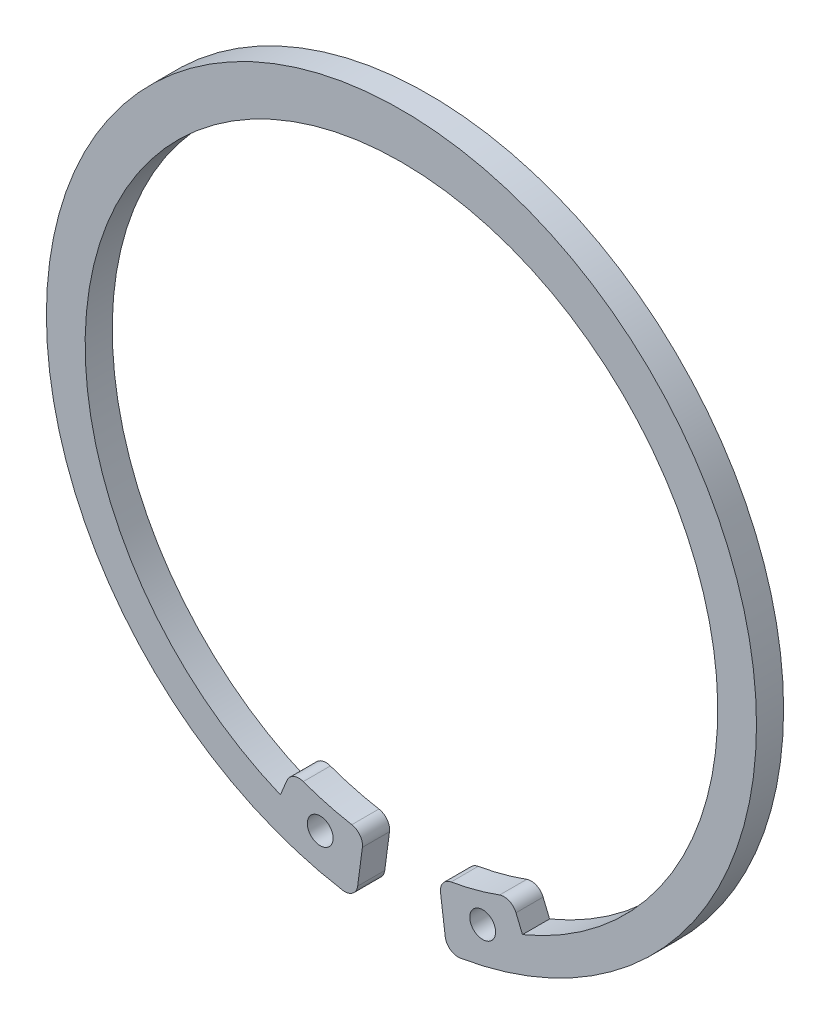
ISO-10303-21;
HEADER;
FILE_DESCRIPTION(('STEP AP214'),'2;1');
FILE_NAME('part.step','',(''),(''),'','','');
FILE_SCHEMA(('AUTOMOTIVE_DESIGN { 1 0 10303 214 1 1 1 1 }'));
ENDSEC;
DATA;
#1=APPLICATION_CONTEXT('core data for automotive mechanical design processes');
#2=APPLICATION_PROTOCOL_DEFINITION('international standard','automotive_design',2000,#1);
#3=PRODUCT_CONTEXT('',#1,'mechanical');
#4=PRODUCT('Part','Part','',(#3));
#5=PRODUCT_RELATED_PRODUCT_CATEGORY('part','',(#4));
#6=PRODUCT_DEFINITION_FORMATION('','',#4);
#7=PRODUCT_DEFINITION_CONTEXT('part definition',#1,'design');
#8=PRODUCT_DEFINITION('design','',#6,#7);
#9=PRODUCT_DEFINITION_SHAPE('','',#8);
#10=(LENGTH_UNIT() NAMED_UNIT(*) SI_UNIT(.MILLI.,.METRE.));
#11=(NAMED_UNIT(*) PLANE_ANGLE_UNIT() SI_UNIT($,.RADIAN.));
#12=(NAMED_UNIT(*) SI_UNIT($,.STERADIAN.) SOLID_ANGLE_UNIT());
#13=UNCERTAINTY_MEASURE_WITH_UNIT(LENGTH_MEASURE(1.E-05),#10,'distance_accuracy_value','');
#14=(GEOMETRIC_REPRESENTATION_CONTEXT(3) GLOBAL_UNCERTAINTY_ASSIGNED_CONTEXT((#13)) GLOBAL_UNIT_ASSIGNED_CONTEXT((#10,
#11,#12)) REPRESENTATION_CONTEXT('',''));
#15=CARTESIAN_POINT('',(0.,0.,0.));
#16=DIRECTION('',(0.,0.,1.));
#17=DIRECTION('',(1.,0.,0.));
#18=AXIS2_PLACEMENT_3D('',#15,#16,#17);
#19=CARTESIAN_POINT('',(7.94773359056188,-21.8006521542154,2.1));
#20=DIRECTION('',(0.,0.,-1.));
#21=DIRECTION('',(-1.,0.,0.));
#22=AXIS2_PLACEMENT_3D('',#19,#20,#21);
#23=PLANE('',#22);
#24=CARTESIAN_POINT('',(-6.29237926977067,-23.5049666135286,2.1));
#25=DIRECTION('',(0.,0.,1.));
#26=DIRECTION('',(1.,0.,0.));
#27=AXIS2_PLACEMENT_3D('',#24,#25,#26);
#28=CIRCLE('',#27,1.);
#29=CARTESIAN_POINT('',(-5.29237926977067,-23.5049666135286,2.1));
#30=VERTEX_POINT('',#29);
#31=EDGE_CURVE('E151',#30,#30,#28,.T.);
#32=ORIENTED_EDGE('',*,*,#31,.F.);
#33=EDGE_LOOP('',(#32));
#34=FACE_BOUND('',#33,.T.);
#35=CARTESIAN_POINT('',(7.94773359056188,-21.8006521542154,2.1));
#36=DIRECTION('',(0.,0.,1.));
#37=DIRECTION('',(-1.,0.,0.));
#38=AXIS2_PLACEMENT_3D('',#35,#36,#37);
#39=CIRCLE('',#38,0.999999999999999);
#40=CARTESIAN_POINT('',(8.87161312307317,-21.4179687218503,2.1));
#41=VERTEX_POINT('',#40);
#42=CARTESIAN_POINT('',(7.60522087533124,-20.8611389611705,2.1));
#43=VERTEX_POINT('',#42);
#44=EDGE_CURVE('E181',#41,#43,#39,.T.);
#45=ORIENTED_EDGE('',*,*,#44,.T.);
#46=CARTESIAN_POINT('',(0.,0.,2.1));
#47=DIRECTION('',(0.,0.,-1.));
#48=DIRECTION('',(1.,0.,0.));
#49=AXIS2_PLACEMENT_3D('',#46,#47,#48);
#50=CIRCLE('',#49,22.2042001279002);
#51=CARTESIAN_POINT('',(3.8442550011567,-21.8688867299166,2.1));
#52=VERTEX_POINT('',#51);
#53=EDGE_CURVE('E146',#43,#52,#50,.T.);
#54=ORIENTED_EDGE('',*,*,#53,.T.);
#55=CARTESIAN_POINT('',(4.01738688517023,-22.8537853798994,2.1));
#56=DIRECTION('',(0.,0.,1.));
#57=DIRECTION('',(-1.,0.,0.));
#58=AXIS2_PLACEMENT_3D('',#55,#56,#57);
#59=CIRCLE('',#58,1.);
#60=CARTESIAN_POINT('',(3.02594202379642,-22.9843115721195,2.1));
#61=VERTEX_POINT('',#60);
#62=EDGE_CURVE('E184',#52,#61,#59,.T.);
#63=ORIENTED_EDGE('',*,*,#62,.T.);
#64=DIRECTION('',(0.130526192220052,-0.99144486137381,0.));
#65=VECTOR('',#64,1.);
#66=CARTESIAN_POINT('',(3.39208686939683,-25.7654577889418,2.1));
#67=LINE('',#66,#65);
#68=CARTESIAN_POINT('',(3.39208686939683,-25.7654577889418,2.1));
#69=VERTEX_POINT('',#68);
#70=EDGE_CURVE('E186',#61,#69,#67,.T.);
#71=ORIENTED_EDGE('',*,*,#70,.T.);
#72=CARTESIAN_POINT('',(4.38353173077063,-25.6349315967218,2.1));
#73=DIRECTION('',(0.,0.,1.));
#74=DIRECTION('',(-1.,0.,0.));
#75=AXIS2_PLACEMENT_3D('',#72,#73,#74);
#76=CIRCLE('',#75,0.999999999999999);
#77=CARTESIAN_POINT('',(4.54894802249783,-26.6211554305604,2.1));
#78=VERTEX_POINT('',#77);
#79=EDGE_CURVE('E188',#69,#78,#76,.T.);
#80=ORIENTED_EDGE('',*,*,#79,.T.);
#81=CARTESIAN_POINT('',(0.,0.5,2.1));
#82=DIRECTION('',(0.,0.,1.));
#83=DIRECTION('',(1.,0.,0.));
#84=AXIS2_PLACEMENT_3D('',#81,#82,#83);
#85=CIRCLE('',#84,27.5);
#86=CARTESIAN_POINT('',(-4.54894802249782,-26.6211554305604,2.1));
#87=VERTEX_POINT('',#86);
#88=EDGE_CURVE('E190',#78,#87,#85,.T.);
#89=ORIENTED_EDGE('',*,*,#88,.T.);
#90=CARTESIAN_POINT('',(-4.38353173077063,-25.6349315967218,2.1));
#91=DIRECTION('',(0.,0.,1.));
#92=DIRECTION('',(1.,0.,0.));
#93=AXIS2_PLACEMENT_3D('',#90,#91,#92);
#94=CIRCLE('',#93,0.999999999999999);
#95=CARTESIAN_POINT('',(-3.39208686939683,-25.7654577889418,2.1));
#96=VERTEX_POINT('',#95);
#97=EDGE_CURVE('E192',#87,#96,#94,.T.);
#98=ORIENTED_EDGE('',*,*,#97,.T.);
#99=DIRECTION('',(0.130526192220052,0.99144486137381,0.));
#100=VECTOR('',#99,1.);
#101=CARTESIAN_POINT('',(-3.39208686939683,-25.7654577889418,2.1));
#102=LINE('',#101,#100);
#103=CARTESIAN_POINT('',(-3.02594202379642,-22.9843115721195,2.1));
#104=VERTEX_POINT('',#103);
#105=EDGE_CURVE('E194',#96,#104,#102,.T.);
#106=ORIENTED_EDGE('',*,*,#105,.T.);
#107=CARTESIAN_POINT('',(-4.01738688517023,-22.8537853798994,2.1));
#108=DIRECTION('',(0.,0.,1.));
#109=DIRECTION('',(1.,0.,0.));
#110=AXIS2_PLACEMENT_3D('',#107,#108,#109);
#111=CIRCLE('',#110,1.);
#112=CARTESIAN_POINT('',(-3.84425500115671,-21.8688867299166,2.1));
#113=VERTEX_POINT('',#112);
#114=EDGE_CURVE('E196',#104,#113,#111,.T.);
#115=ORIENTED_EDGE('',*,*,#114,.T.);
#116=CARTESIAN_POINT('',(0.,0.,2.1));
#117=DIRECTION('',(0.,0.,-1.));
#118=DIRECTION('',(1.,0.,0.));
#119=AXIS2_PLACEMENT_3D('',#116,#117,#118);
#120=CIRCLE('',#119,22.2042001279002);
#121=CARTESIAN_POINT('',(-7.60522087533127,-20.8611389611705,2.1));
#122=VERTEX_POINT('',#121);
#123=EDGE_CURVE('E198',#113,#122,#120,.T.);
#124=ORIENTED_EDGE('',*,*,#123,.T.);
#125=CARTESIAN_POINT('',(-7.94773359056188,-21.8006521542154,2.1));
#126=DIRECTION('',(0.,0.,1.));
#127=DIRECTION('',(-1.,0.,0.));
#128=AXIS2_PLACEMENT_3D('',#125,#126,#127);
#129=CIRCLE('',#128,0.999999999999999);
#130=CARTESIAN_POINT('',(-8.87161312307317,-21.4179687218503,2.1));
#131=VERTEX_POINT('',#130);
#132=EDGE_CURVE('E200',#122,#131,#129,.T.);
#133=ORIENTED_EDGE('',*,*,#132,.T.);
#134=DIRECTION('',(-0.382683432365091,-0.923879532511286,0.));
#135=VECTOR('',#134,1.);
#136=CARTESIAN_POINT('',(-8.87161312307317,-21.4179687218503,2.1));
#137=LINE('',#136,#135);
#138=CARTESIAN_POINT('',(-9.37574409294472,-22.6350485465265,2.1));
#139=VERTEX_POINT('',#138);
#140=EDGE_CURVE('E202',#131,#139,#137,.T.);
#141=ORIENTED_EDGE('',*,*,#140,.T.);
#142=CARTESIAN_POINT('',(0.,0.,2.1));
#143=DIRECTION('',(0.,0.,-1.));
#144=DIRECTION('',(1.,0.,0.));
#145=AXIS2_PLACEMENT_3D('',#142,#143,#144);
#146=CIRCLE('',#145,24.5);
#147=CARTESIAN_POINT('',(9.37574409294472,-22.6350485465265,2.1));
#148=VERTEX_POINT('',#147);
#149=EDGE_CURVE('E51',#139,#148,#146,.T.);
#150=ORIENTED_EDGE('',*,*,#149,.T.);
#151=DIRECTION('',(-0.382683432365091,0.923879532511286,0.));
#152=VECTOR('',#151,1.);
#153=CARTESIAN_POINT('',(8.87161312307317,-21.4179687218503,2.1));
#154=LINE('',#153,#152);
#155=EDGE_CURVE('E46',#148,#41,#154,.T.);
#156=ORIENTED_EDGE('',*,*,#155,.T.);
#157=EDGE_LOOP('',(#45,#54,#63,#71,#80,#89,#98,#106,#115,#124,#133,#141,#150,#156));
#158=FACE_BOUND('',#157,.T.);
#159=CARTESIAN_POINT('',(6.29237926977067,-23.5049666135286,2.1));
#160=DIRECTION('',(0.,0.,1.));
#161=DIRECTION('',(-1.,0.,0.));
#162=AXIS2_PLACEMENT_3D('',#159,#160,#161);
#163=CIRCLE('',#162,1.);
#164=CARTESIAN_POINT('',(5.29237926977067,-23.5049666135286,2.1));
#165=VERTEX_POINT('',#164);
#166=EDGE_CURVE('E321',#165,#165,#163,.T.);
#167=ORIENTED_EDGE('',*,*,#166,.F.);
#168=EDGE_LOOP('',(#167));
#169=FACE_BOUND('',#168,.T.);
#170=ADVANCED_FACE('F31',(#34,#158,#169),#23,.F.);
#171=CARTESIAN_POINT('',(7.94773359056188,-21.8006521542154,0.));
#172=DIRECTION('',(0.,0.,-1.));
#173=DIRECTION('',(-1.,0.,0.));
#174=AXIS2_PLACEMENT_3D('',#171,#172,#173);
#175=PLANE('',#174);
#176=CARTESIAN_POINT('',(-6.29237926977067,-23.5049666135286,0.));
#177=DIRECTION('',(0.,0.,1.));
#178=DIRECTION('',(1.,0.,0.));
#179=AXIS2_PLACEMENT_3D('',#176,#177,#178);
#180=CIRCLE('',#179,1.);
#181=CARTESIAN_POINT('',(-5.29237926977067,-23.5049666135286,0.));
#182=VERTEX_POINT('',#181);
#183=EDGE_CURVE('E154',#182,#182,#180,.T.);
#184=ORIENTED_EDGE('',*,*,#183,.T.);
#185=EDGE_LOOP('',(#184));
#186=FACE_BOUND('',#185,.T.);
#187=CARTESIAN_POINT('',(7.94773359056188,-21.8006521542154,0.));
#188=DIRECTION('',(0.,0.,1.));
#189=DIRECTION('',(-1.,0.,0.));
#190=AXIS2_PLACEMENT_3D('',#187,#188,#189);
#191=CIRCLE('',#190,0.999999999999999);
#192=CARTESIAN_POINT('',(8.87161312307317,-21.4179687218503,0.));
#193=VERTEX_POINT('',#192);
#194=CARTESIAN_POINT('',(7.60522087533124,-20.8611389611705,0.));
#195=VERTEX_POINT('',#194);
#196=EDGE_CURVE('E137',#193,#195,#191,.T.);
#197=ORIENTED_EDGE('',*,*,#196,.F.);
#198=DIRECTION('',(-0.382683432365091,0.923879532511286,0.));
#199=VECTOR('',#198,1.);
#200=CARTESIAN_POINT('',(8.87161312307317,-21.4179687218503,0.));
#201=LINE('',#200,#199);
#202=CARTESIAN_POINT('',(9.37574409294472,-22.6350485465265,0.));
#203=VERTEX_POINT('',#202);
#204=EDGE_CURVE('E179',#203,#193,#201,.T.);
#205=ORIENTED_EDGE('',*,*,#204,.F.);
#206=CARTESIAN_POINT('',(0.,0.,0.));
#207=DIRECTION('',(0.,0.,-1.));
#208=DIRECTION('',(1.,0.,0.));
#209=AXIS2_PLACEMENT_3D('',#206,#207,#208);
#210=CIRCLE('',#209,24.5);
#211=CARTESIAN_POINT('',(-9.37574409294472,-22.6350485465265,0.));
#212=VERTEX_POINT('',#211);
#213=EDGE_CURVE('E177',#212,#203,#210,.T.);
#214=ORIENTED_EDGE('',*,*,#213,.F.);
#215=DIRECTION('',(-0.382683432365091,-0.923879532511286,0.));
#216=VECTOR('',#215,1.);
#217=CARTESIAN_POINT('',(-8.87161312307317,-21.4179687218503,0.));
#218=LINE('',#217,#216);
#219=CARTESIAN_POINT('',(-8.87161312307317,-21.4179687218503,0.));
#220=VERTEX_POINT('',#219);
#221=EDGE_CURVE('E175',#220,#212,#218,.T.);
#222=ORIENTED_EDGE('',*,*,#221,.F.);
#223=CARTESIAN_POINT('',(-7.94773359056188,-21.8006521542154,0.));
#224=DIRECTION('',(0.,0.,1.));
#225=DIRECTION('',(-1.,0.,0.));
#226=AXIS2_PLACEMENT_3D('',#223,#224,#225);
#227=CIRCLE('',#226,0.999999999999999);
#228=CARTESIAN_POINT('',(-7.60522087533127,-20.8611389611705,0.));
#229=VERTEX_POINT('',#228);
#230=EDGE_CURVE('E173',#229,#220,#227,.T.);
#231=ORIENTED_EDGE('',*,*,#230,.F.);
#232=CARTESIAN_POINT('',(0.,0.,0.));
#233=DIRECTION('',(0.,0.,-1.));
#234=DIRECTION('',(1.,0.,0.));
#235=AXIS2_PLACEMENT_3D('',#232,#233,#234);
#236=CIRCLE('',#235,22.2042001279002);
#237=CARTESIAN_POINT('',(-3.84425500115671,-21.8688867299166,0.));
#238=VERTEX_POINT('',#237);
#239=EDGE_CURVE('E171',#238,#229,#236,.T.);
#240=ORIENTED_EDGE('',*,*,#239,.F.);
#241=CARTESIAN_POINT('',(-4.01738688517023,-22.8537853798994,0.));
#242=DIRECTION('',(0.,0.,1.));
#243=DIRECTION('',(1.,0.,0.));
#244=AXIS2_PLACEMENT_3D('',#241,#242,#243);
#245=CIRCLE('',#244,1.);
#246=CARTESIAN_POINT('',(-3.02594202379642,-22.9843115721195,0.));
#247=VERTEX_POINT('',#246);
#248=EDGE_CURVE('E169',#247,#238,#245,.T.);
#249=ORIENTED_EDGE('',*,*,#248,.F.);
#250=DIRECTION('',(0.130526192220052,0.99144486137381,0.));
#251=VECTOR('',#250,1.);
#252=CARTESIAN_POINT('',(-3.39208686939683,-25.7654577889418,0.));
#253=LINE('',#252,#251);
#254=CARTESIAN_POINT('',(-3.39208686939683,-25.7654577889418,0.));
#255=VERTEX_POINT('',#254);
#256=EDGE_CURVE('E167',#255,#247,#253,.T.);
#257=ORIENTED_EDGE('',*,*,#256,.F.);
#258=CARTESIAN_POINT('',(-4.38353173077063,-25.6349315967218,0.));
#259=DIRECTION('',(0.,0.,1.));
#260=DIRECTION('',(1.,0.,0.));
#261=AXIS2_PLACEMENT_3D('',#258,#259,#260);
#262=CIRCLE('',#261,0.999999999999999);
#263=CARTESIAN_POINT('',(-4.54894802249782,-26.6211554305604,0.));
#264=VERTEX_POINT('',#263);
#265=EDGE_CURVE('E165',#264,#255,#262,.T.);
#266=ORIENTED_EDGE('',*,*,#265,.F.);
#267=CARTESIAN_POINT('',(0.,0.5,0.));
#268=DIRECTION('',(0.,0.,1.));
#269=DIRECTION('',(1.,0.,0.));
#270=AXIS2_PLACEMENT_3D('',#267,#268,#269);
#271=CIRCLE('',#270,27.5);
#272=CARTESIAN_POINT('',(4.54894802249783,-26.6211554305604,0.));
#273=VERTEX_POINT('',#272);
#274=EDGE_CURVE('E163',#273,#264,#271,.T.);
#275=ORIENTED_EDGE('',*,*,#274,.F.);
#276=CARTESIAN_POINT('',(4.38353173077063,-25.6349315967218,0.));
#277=DIRECTION('',(0.,0.,1.));
#278=DIRECTION('',(-1.,0.,0.));
#279=AXIS2_PLACEMENT_3D('',#276,#277,#278);
#280=CIRCLE('',#279,0.999999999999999);
#281=CARTESIAN_POINT('',(3.39208686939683,-25.7654577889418,0.));
#282=VERTEX_POINT('',#281);
#283=EDGE_CURVE('E161',#282,#273,#280,.T.);
#284=ORIENTED_EDGE('',*,*,#283,.F.);
#285=DIRECTION('',(0.130526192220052,-0.99144486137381,0.));
#286=VECTOR('',#285,1.);
#287=CARTESIAN_POINT('',(3.39208686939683,-25.7654577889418,0.));
#288=LINE('',#287,#286);
#289=CARTESIAN_POINT('',(3.02594202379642,-22.9843115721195,0.));
#290=VERTEX_POINT('',#289);
#291=EDGE_CURVE('E159',#290,#282,#288,.T.);
#292=ORIENTED_EDGE('',*,*,#291,.F.);
#293=CARTESIAN_POINT('',(4.01738688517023,-22.8537853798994,0.));
#294=DIRECTION('',(0.,0.,1.));
#295=DIRECTION('',(-1.,0.,0.));
#296=AXIS2_PLACEMENT_3D('',#293,#294,#295);
#297=CIRCLE('',#296,1.);
#298=CARTESIAN_POINT('',(3.8442550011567,-21.8688867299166,0.));
#299=VERTEX_POINT('',#298);
#300=EDGE_CURVE('E139',#299,#290,#297,.T.);
#301=ORIENTED_EDGE('',*,*,#300,.F.);
#302=CARTESIAN_POINT('',(0.,0.,0.));
#303=DIRECTION('',(0.,0.,-1.));
#304=DIRECTION('',(1.,0.,0.));
#305=AXIS2_PLACEMENT_3D('',#302,#303,#304);
#306=CIRCLE('',#305,22.2042001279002);
#307=EDGE_CURVE('E132',#195,#299,#306,.T.);
#308=ORIENTED_EDGE('',*,*,#307,.F.);
#309=EDGE_LOOP('',(#197,#205,#214,#222,#231,#240,#249,#257,#266,#275,#284,#292,#301,#308));
#310=FACE_BOUND('',#309,.T.);
#311=CARTESIAN_POINT('',(6.29237926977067,-23.5049666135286,0.));
#312=DIRECTION('',(0.,0.,1.));
#313=DIRECTION('',(-1.,0.,0.));
#314=AXIS2_PLACEMENT_3D('',#311,#312,#313);
#315=CIRCLE('',#314,1.);
#316=CARTESIAN_POINT('',(5.29237926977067,-23.5049666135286,0.));
#317=VERTEX_POINT('',#316);
#318=EDGE_CURVE('E324',#317,#317,#315,.T.);
#319=ORIENTED_EDGE('',*,*,#318,.T.);
#320=EDGE_LOOP('',(#319));
#321=FACE_BOUND('',#320,.T.);
#322=ADVANCED_FACE('F133',(#186,#310,#321),#175,.T.);
#323=CARTESIAN_POINT('',(7.94773359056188,-21.8006521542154,2.1));
#324=DIRECTION('',(0.,0.,-1.));
#325=DIRECTION('',(-1.,0.,0.));
#326=AXIS2_PLACEMENT_3D('',#323,#324,#325);
#327=CYLINDRICAL_SURFACE('',#326,0.999999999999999);
#328=ORIENTED_EDGE('',*,*,#196,.T.);
#329=DIRECTION('',(0.,0.,-1.));
#330=VECTOR('',#329,1.);
#331=CARTESIAN_POINT('',(7.60522087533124,-20.8611389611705,2.1));
#332=LINE('',#331,#330);
#333=EDGE_CURVE('E11',#43,#195,#332,.T.);
#334=ORIENTED_EDGE('',*,*,#333,.F.);
#335=ORIENTED_EDGE('',*,*,#44,.F.);
#336=DIRECTION('',(0.,0.,-1.));
#337=VECTOR('',#336,1.);
#338=CARTESIAN_POINT('',(8.87161312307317,-21.4179687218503,2.1));
#339=LINE('',#338,#337);
#340=EDGE_CURVE('E150',#41,#193,#339,.T.);
#341=ORIENTED_EDGE('',*,*,#340,.T.);
#342=EDGE_LOOP('',(#328,#334,#335,#341));
#343=FACE_BOUND('',#342,.T.);
#344=ADVANCED_FACE('F33',(#343),#327,.T.);
#345=CARTESIAN_POINT('',(0.,0.,2.1));
#346=DIRECTION('',(0.,0.,-1.));
#347=DIRECTION('',(-1.,0.,0.));
#348=AXIS2_PLACEMENT_3D('',#345,#346,#347);
#349=CYLINDRICAL_SURFACE('',#348,22.2042001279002);
#350=ORIENTED_EDGE('',*,*,#307,.T.);
#351=DIRECTION('',(0.,0.,-1.));
#352=VECTOR('',#351,1.);
#353=CARTESIAN_POINT('',(3.8442550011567,-21.8688867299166,2.1));
#354=LINE('',#353,#352);
#355=EDGE_CURVE('E39',#52,#299,#354,.T.);
#356=ORIENTED_EDGE('',*,*,#355,.F.);
#357=ORIENTED_EDGE('',*,*,#53,.F.);
#358=ORIENTED_EDGE('',*,*,#333,.T.);
#359=EDGE_LOOP('',(#350,#356,#357,#358));
#360=FACE_BOUND('',#359,.T.);
#361=ADVANCED_FACE('F145',(#360),#349,.F.);
#362=CARTESIAN_POINT('',(4.01738688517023,-22.8537853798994,2.1));
#363=DIRECTION('',(0.,0.,-1.));
#364=DIRECTION('',(-1.,0.,0.));
#365=AXIS2_PLACEMENT_3D('',#362,#363,#364);
#366=CYLINDRICAL_SURFACE('',#365,1.);
#367=ORIENTED_EDGE('',*,*,#300,.T.);
#368=DIRECTION('',(0.,0.,-1.));
#369=VECTOR('',#368,1.);
#370=CARTESIAN_POINT('',(3.02594202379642,-22.9843115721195,2.1));
#371=LINE('',#370,#369);
#372=EDGE_CURVE('E237',#61,#290,#371,.T.);
#373=ORIENTED_EDGE('',*,*,#372,.F.);
#374=ORIENTED_EDGE('',*,*,#62,.F.);
#375=ORIENTED_EDGE('',*,*,#355,.T.);
#376=EDGE_LOOP('',(#367,#373,#374,#375));
#377=FACE_BOUND('',#376,.T.);
#378=ADVANCED_FACE('F241',(#377),#366,.T.);
#379=CARTESIAN_POINT('',(3.39208686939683,-25.7654577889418,2.1));
#380=DIRECTION('',(0.99144486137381,0.130526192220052,0.));
#381=DIRECTION('',(-0.130526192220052,0.99144486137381,0.));
#382=AXIS2_PLACEMENT_3D('',#379,#380,#381);
#383=PLANE('',#382);
#384=ORIENTED_EDGE('',*,*,#291,.T.);
#385=DIRECTION('',(0.,0.,-1.));
#386=VECTOR('',#385,1.);
#387=CARTESIAN_POINT('',(3.39208686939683,-25.7654577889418,2.1));
#388=LINE('',#387,#386);
#389=EDGE_CURVE('E234',#69,#282,#388,.T.);
#390=ORIENTED_EDGE('',*,*,#389,.F.);
#391=ORIENTED_EDGE('',*,*,#70,.F.);
#392=ORIENTED_EDGE('',*,*,#372,.T.);
#393=EDGE_LOOP('',(#384,#390,#391,#392));
#394=FACE_BOUND('',#393,.T.);
#395=ADVANCED_FACE('F249',(#394),#383,.F.);
#396=CARTESIAN_POINT('',(4.38353173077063,-25.6349315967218,2.1));
#397=DIRECTION('',(0.,0.,-1.));
#398=DIRECTION('',(-1.,0.,0.));
#399=AXIS2_PLACEMENT_3D('',#396,#397,#398);
#400=CYLINDRICAL_SURFACE('',#399,0.999999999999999);
#401=ORIENTED_EDGE('',*,*,#283,.T.);
#402=DIRECTION('',(0.,0.,-1.));
#403=VECTOR('',#402,1.);
#404=CARTESIAN_POINT('',(4.54894802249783,-26.6211554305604,2.1));
#405=LINE('',#404,#403);
#406=EDGE_CURVE('E231',#78,#273,#405,.T.);
#407=ORIENTED_EDGE('',*,*,#406,.F.);
#408=ORIENTED_EDGE('',*,*,#79,.F.);
#409=ORIENTED_EDGE('',*,*,#389,.T.);
#410=EDGE_LOOP('',(#401,#407,#408,#409));
#411=FACE_BOUND('',#410,.T.);
#412=ADVANCED_FACE('F252',(#411),#400,.T.);
#413=CARTESIAN_POINT('',(0.,0.5,2.1));
#414=DIRECTION('',(0.,0.,-1.));
#415=DIRECTION('',(-1.,0.,0.));
#416=AXIS2_PLACEMENT_3D('',#413,#414,#415);
#417=CYLINDRICAL_SURFACE('',#416,27.5);
#418=ORIENTED_EDGE('',*,*,#274,.T.);
#419=DIRECTION('',(0.,0.,-1.));
#420=VECTOR('',#419,1.);
#421=CARTESIAN_POINT('',(-4.54894802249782,-26.6211554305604,2.1));
#422=LINE('',#421,#420);
#423=EDGE_CURVE('E228',#87,#264,#422,.T.);
#424=ORIENTED_EDGE('',*,*,#423,.F.);
#425=ORIENTED_EDGE('',*,*,#88,.F.);
#426=ORIENTED_EDGE('',*,*,#406,.T.);
#427=EDGE_LOOP('',(#418,#424,#425,#426));
#428=FACE_BOUND('',#427,.T.);
#429=ADVANCED_FACE('F257',(#428),#417,.T.);
#430=CARTESIAN_POINT('',(-4.38353173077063,-25.6349315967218,2.1));
#431=DIRECTION('',(0.,0.,-1.));
#432=DIRECTION('',(-1.,0.,0.));
#433=AXIS2_PLACEMENT_3D('',#430,#431,#432);
#434=CYLINDRICAL_SURFACE('',#433,0.999999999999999);
#435=ORIENTED_EDGE('',*,*,#265,.T.);
#436=DIRECTION('',(0.,0.,-1.));
#437=VECTOR('',#436,1.);
#438=CARTESIAN_POINT('',(-3.39208686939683,-25.7654577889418,2.1));
#439=LINE('',#438,#437);
#440=EDGE_CURVE('E225',#96,#255,#439,.T.);
#441=ORIENTED_EDGE('',*,*,#440,.F.);
#442=ORIENTED_EDGE('',*,*,#97,.F.);
#443=ORIENTED_EDGE('',*,*,#423,.T.);
#444=EDGE_LOOP('',(#435,#441,#442,#443));
#445=FACE_BOUND('',#444,.T.);
#446=ADVANCED_FACE('F263',(#445),#434,.T.);
#447=CARTESIAN_POINT('',(-3.39208686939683,-25.7654577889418,2.1));
#448=DIRECTION('',(-0.99144486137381,0.130526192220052,0.));
#449=DIRECTION('',(-0.130526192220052,-0.99144486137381,0.));
#450=AXIS2_PLACEMENT_3D('',#447,#448,#449);
#451=PLANE('',#450);
#452=ORIENTED_EDGE('',*,*,#256,.T.);
#453=DIRECTION('',(0.,0.,-1.));
#454=VECTOR('',#453,1.);
#455=CARTESIAN_POINT('',(-3.02594202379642,-22.9843115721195,2.1));
#456=LINE('',#455,#454);
#457=EDGE_CURVE('E222',#104,#247,#456,.T.);
#458=ORIENTED_EDGE('',*,*,#457,.F.);
#459=ORIENTED_EDGE('',*,*,#105,.F.);
#460=ORIENTED_EDGE('',*,*,#440,.T.);
#461=EDGE_LOOP('',(#452,#458,#459,#460));
#462=FACE_BOUND('',#461,.T.);
#463=ADVANCED_FACE('F267',(#462),#451,.F.);
#464=CARTESIAN_POINT('',(-4.01738688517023,-22.8537853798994,2.1));
#465=DIRECTION('',(0.,0.,-1.));
#466=DIRECTION('',(-1.,0.,0.));
#467=AXIS2_PLACEMENT_3D('',#464,#465,#466);
#468=CYLINDRICAL_SURFACE('',#467,1.);
#469=ORIENTED_EDGE('',*,*,#248,.T.);
#470=DIRECTION('',(0.,0.,-1.));
#471=VECTOR('',#470,1.);
#472=CARTESIAN_POINT('',(-3.84425500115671,-21.8688867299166,2.1));
#473=LINE('',#472,#471);
#474=EDGE_CURVE('E219',#113,#238,#473,.T.);
#475=ORIENTED_EDGE('',*,*,#474,.F.);
#476=ORIENTED_EDGE('',*,*,#114,.F.);
#477=ORIENTED_EDGE('',*,*,#457,.T.);
#478=EDGE_LOOP('',(#469,#475,#476,#477));
#479=FACE_BOUND('',#478,.T.);
#480=ADVANCED_FACE('F272',(#479),#468,.T.);
#481=CARTESIAN_POINT('',(0.,0.,2.1));
#482=DIRECTION('',(0.,0.,-1.));
#483=DIRECTION('',(-1.,0.,0.));
#484=AXIS2_PLACEMENT_3D('',#481,#482,#483);
#485=CYLINDRICAL_SURFACE('',#484,22.2042001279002);
#486=ORIENTED_EDGE('',*,*,#239,.T.);
#487=DIRECTION('',(0.,0.,-1.));
#488=VECTOR('',#487,1.);
#489=CARTESIAN_POINT('',(-7.60522087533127,-20.8611389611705,2.1));
#490=LINE('',#489,#488);
#491=EDGE_CURVE('E216',#122,#229,#490,.T.);
#492=ORIENTED_EDGE('',*,*,#491,.F.);
#493=ORIENTED_EDGE('',*,*,#123,.F.);
#494=ORIENTED_EDGE('',*,*,#474,.T.);
#495=EDGE_LOOP('',(#486,#492,#493,#494));
#496=FACE_BOUND('',#495,.T.);
#497=ADVANCED_FACE('F278',(#496),#485,.F.);
#498=CARTESIAN_POINT('',(-7.94773359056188,-21.8006521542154,2.1));
#499=DIRECTION('',(0.,0.,-1.));
#500=DIRECTION('',(-1.,0.,0.));
#501=AXIS2_PLACEMENT_3D('',#498,#499,#500);
#502=CYLINDRICAL_SURFACE('',#501,0.999999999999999);
#503=ORIENTED_EDGE('',*,*,#230,.T.);
#504=DIRECTION('',(0.,0.,-1.));
#505=VECTOR('',#504,1.);
#506=CARTESIAN_POINT('',(-8.87161312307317,-21.4179687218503,2.1));
#507=LINE('',#506,#505);
#508=EDGE_CURVE('E213',#131,#220,#507,.T.);
#509=ORIENTED_EDGE('',*,*,#508,.F.);
#510=ORIENTED_EDGE('',*,*,#132,.F.);
#511=ORIENTED_EDGE('',*,*,#491,.T.);
#512=EDGE_LOOP('',(#503,#509,#510,#511));
#513=FACE_BOUND('',#512,.T.);
#514=ADVANCED_FACE('F282',(#513),#502,.T.);
#515=CARTESIAN_POINT('',(-8.87161312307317,-21.4179687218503,2.1));
#516=DIRECTION('',(0.923879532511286,-0.382683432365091,0.));
#517=DIRECTION('',(0.382683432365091,0.923879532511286,0.));
#518=AXIS2_PLACEMENT_3D('',#515,#516,#517);
#519=PLANE('',#518);
#520=ORIENTED_EDGE('',*,*,#221,.T.);
#521=DIRECTION('',(0.,0.,-1.));
#522=VECTOR('',#521,1.);
#523=CARTESIAN_POINT('',(-9.37574409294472,-22.6350485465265,2.1));
#524=LINE('',#523,#522);
#525=EDGE_CURVE('E210',#139,#212,#524,.T.);
#526=ORIENTED_EDGE('',*,*,#525,.F.);
#527=ORIENTED_EDGE('',*,*,#140,.F.);
#528=ORIENTED_EDGE('',*,*,#508,.T.);
#529=EDGE_LOOP('',(#520,#526,#527,#528));
#530=FACE_BOUND('',#529,.T.);
#531=ADVANCED_FACE('F287',(#530),#519,.F.);
#532=CARTESIAN_POINT('',(0.,0.,2.1));
#533=DIRECTION('',(0.,0.,-1.));
#534=DIRECTION('',(-1.,0.,0.));
#535=AXIS2_PLACEMENT_3D('',#532,#533,#534);
#536=CYLINDRICAL_SURFACE('',#535,24.5);
#537=ORIENTED_EDGE('',*,*,#213,.T.);
#538=DIRECTION('',(0.,0.,-1.));
#539=VECTOR('',#538,1.);
#540=CARTESIAN_POINT('',(9.37574409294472,-22.6350485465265,2.1));
#541=LINE('',#540,#539);
#542=EDGE_CURVE('E207',#148,#203,#541,.T.);
#543=ORIENTED_EDGE('',*,*,#542,.F.);
#544=ORIENTED_EDGE('',*,*,#149,.F.);
#545=ORIENTED_EDGE('',*,*,#525,.T.);
#546=EDGE_LOOP('',(#537,#543,#544,#545));
#547=FACE_BOUND('',#546,.T.);
#548=ADVANCED_FACE('F290',(#547),#536,.F.);
#549=CARTESIAN_POINT('',(8.87161312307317,-21.4179687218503,2.1));
#550=DIRECTION('',(-0.923879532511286,-0.382683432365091,0.));
#551=DIRECTION('',(0.382683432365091,-0.923879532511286,0.));
#552=AXIS2_PLACEMENT_3D('',#549,#550,#551);
#553=PLANE('',#552);
#554=ORIENTED_EDGE('',*,*,#204,.T.);
#555=ORIENTED_EDGE('',*,*,#340,.F.);
#556=ORIENTED_EDGE('',*,*,#155,.F.);
#557=ORIENTED_EDGE('',*,*,#542,.T.);
#558=EDGE_LOOP('',(#554,#555,#556,#557));
#559=FACE_BOUND('',#558,.T.);
#560=ADVANCED_FACE('F292',(#559),#553,.F.);
#561=CARTESIAN_POINT('',(-6.29237926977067,-23.5049666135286,2.1));
#562=DIRECTION('',(0.,0.,-1.));
#563=DIRECTION('',(-1.,0.,0.));
#564=AXIS2_PLACEMENT_3D('',#561,#562,#563);
#565=CYLINDRICAL_SURFACE('',#564,1.);
#566=ORIENTED_EDGE('',*,*,#31,.T.);
#567=EDGE_LOOP('',(#566));
#568=FACE_BOUND('',#567,.T.);
#569=ORIENTED_EDGE('',*,*,#183,.F.);
#570=EDGE_LOOP('',(#569));
#571=FACE_BOUND('',#570,.T.);
#572=ADVANCED_FACE('F294',(#568,#571),#565,.F.);
#573=CARTESIAN_POINT('',(6.29237926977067,-23.5049666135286,2.1));
#574=DIRECTION('',(0.,0.,-1.));
#575=DIRECTION('',(-1.,0.,0.));
#576=AXIS2_PLACEMENT_3D('',#573,#574,#575);
#577=CYLINDRICAL_SURFACE('',#576,1.);
#578=ORIENTED_EDGE('',*,*,#166,.T.);
#579=EDGE_LOOP('',(#578));
#580=FACE_BOUND('',#579,.T.);
#581=ORIENTED_EDGE('',*,*,#318,.F.);
#582=EDGE_LOOP('',(#581));
#583=FACE_BOUND('',#582,.T.);
#584=ADVANCED_FACE('F300',(#580,#583),#577,.F.);
#585=CLOSED_SHELL('',(#170,#322,#344,#361,#378,#395,#412,#429,#446,#463,#480,#497,#514,#531,
#548,#560,#572,#584));
#586=MANIFOLD_SOLID_BREP('B2',#585);
#587=ADVANCED_BREP_SHAPE_REPRESENTATION('',(#18,#586),#14);
#588=SHAPE_DEFINITION_REPRESENTATION(#9,#587);
ENDSEC;
END-ISO-10303-21;
